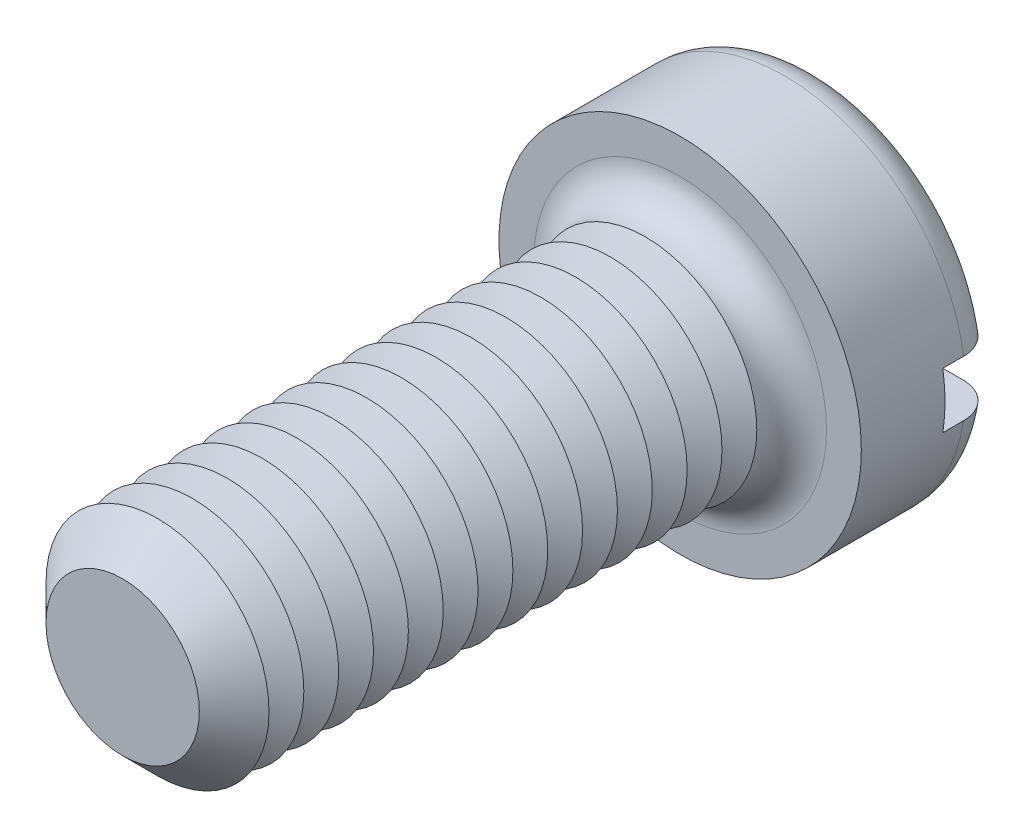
from build123d import *

# Parameters (mm, degrees)
SKETCH3_R           = 6.5
BOSS_EXTRUDE2_DEPTH = 5
SKETCH4_R           = 4
BOSS_EXTRUDE3_DEPTH = 20
FILLET1_R           = 1.25
CHAMFER1_SIZE       = 1.25
LPATTERN1_COUNT     = 14
LPATTERN1_PITCH     = 1.25
SKETCH8_W           = 13
SKETCH8_H           = 2
CUT_EXTRUDE1_DEPTH  = 2


with BuildPart() as part:
    # Sketch3 → Boss-Extrude2 (new body)
    with BuildSketch(Plane.XY):
        Circle(SKETCH3_R)
    extrude(amount=-BOSS_EXTRUDE2_DEPTH)

    # Sketch4 → Boss-Extrude3 (add)
    with BuildSketch(Plane.XY):
        Circle(SKETCH4_R)
    extrude(amount=BOSS_EXTRUDE3_DEPTH)

    # Fillet1
    fillet1_edges = [part.edges().sort_by_distance(p)[0] for p in [
        (-6.5, 0, -5),
        (-4, 0, 0),
    ]]
    fillet(fillet1_edges, radius=FILLET1_R)

    # Chamfer1
    chamfer1_edges = [part.edges().sort_by_distance(p)[0] for p in [
        (-4, 0, 20),
    ]]
    chamfer(chamfer1_edges, length=CHAMFER1_SIZE)

    # Sketch6 → Cut-Revolve1 (revolve, cut)
    with BuildSketch(Plane(origin=(0, 0, 0), x_dir=(0, 0, -1), z_dir=(1, 0, 0)), mode=Mode.PRIVATE) as cut_revolve1_sk:
        Polygon((-1.25, 4), (-1.875, 2.917468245), (-2.5, 4), align=None)
    cut_revolve1 = revolve(cut_revolve1_sk.sketch.rotate(Axis((0, 0, -1.694361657), (0, 0, 1)), 90), axis=Axis((0, 0, -1.694361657), (0, 0, 1)), mode=Mode.SUBTRACT)

    # LPattern1: Cut-Revolve1 ×14
    with Locations(*[(0, 0, i * LPATTERN1_PITCH) for i in range(1, LPATTERN1_COUNT)]):
        add(cut_revolve1, mode=Mode.SUBTRACT)

    # Sketch8 → Cut-Extrude1 (cut)
    with BuildSketch(Plane(origin=(0, 0, -5), x_dir=(-1, 0, 0), z_dir=(0, 0, -1))):
        Rectangle(SKETCH8_W, SKETCH8_H)
    extrude(amount=-CUT_EXTRUDE1_DEPTH, mode=Mode.SUBTRACT)


solid = part.part
